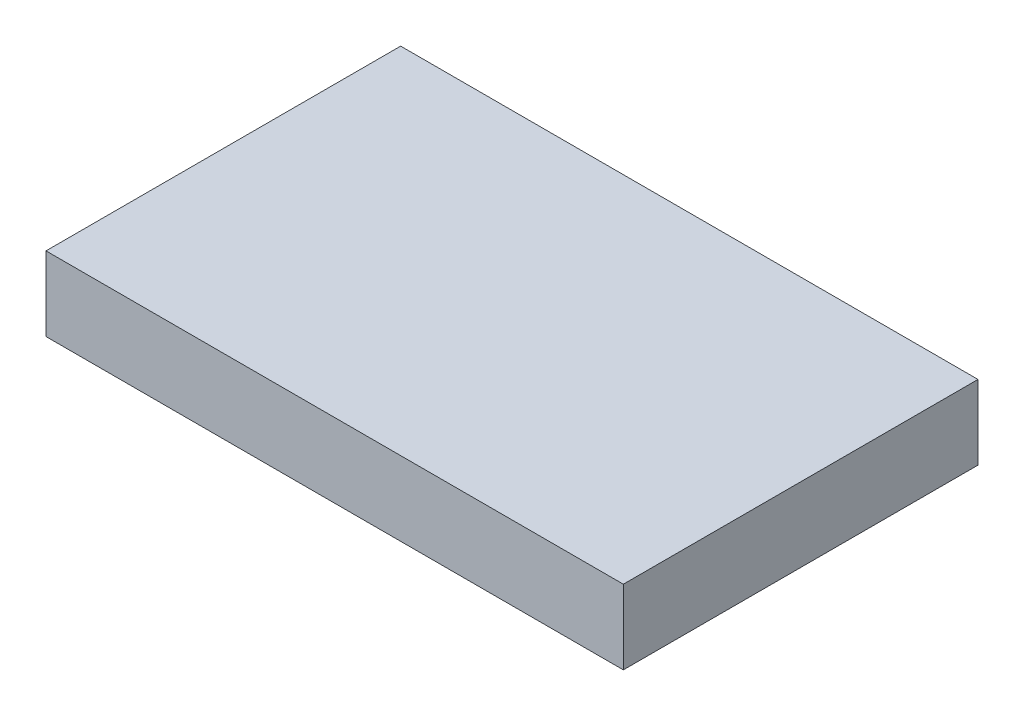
from build123d import *

# Parameters (mm, degrees)
SKETCH1_W      = 140
SKETCH1_H      = 18
EXTRUDE1_DEPTH = 86


with BuildPart() as part:
    # Sketch1 → Extrude1 (new body)
    with BuildSketch(Plane.XY):
        with Locations((70, 9)):
            Rectangle(SKETCH1_W, SKETCH1_H)
    extrude(amount=EXTRUDE1_DEPTH)


solid = part.part
